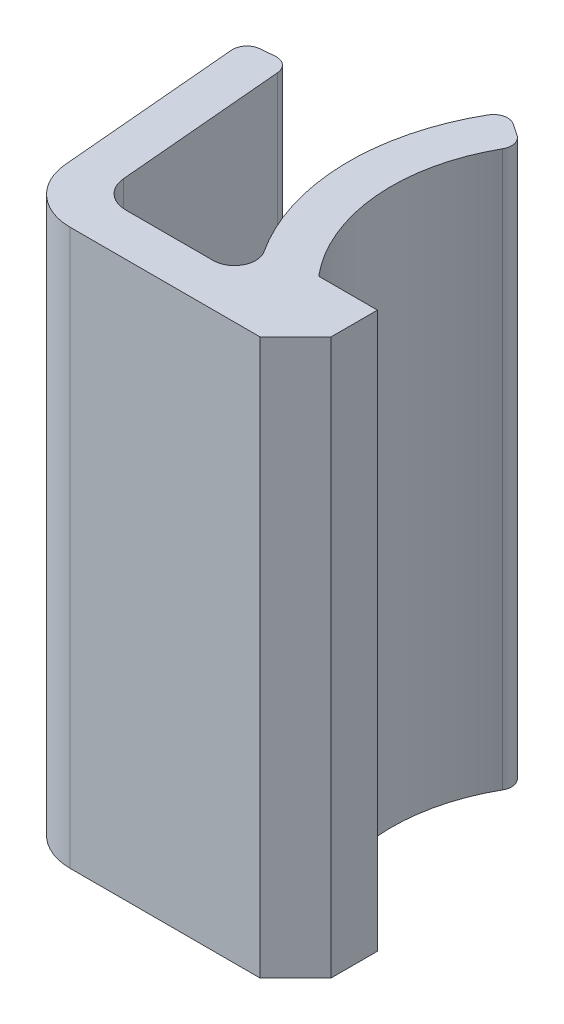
ISO-10303-21;
HEADER;
FILE_DESCRIPTION(('STEP AP214'),'2;1');
FILE_NAME('part.step','',(''),(''),'','','');
FILE_SCHEMA(('AUTOMOTIVE_DESIGN { 1 0 10303 214 1 1 1 1 }'));
ENDSEC;
DATA;
#1=APPLICATION_CONTEXT('core data for automotive mechanical design processes');
#2=APPLICATION_PROTOCOL_DEFINITION('international standard','automotive_design',2000,#1);
#3=PRODUCT_CONTEXT('',#1,'mechanical');
#4=PRODUCT('Part','Part','',(#3));
#5=PRODUCT_RELATED_PRODUCT_CATEGORY('part','',(#4));
#6=PRODUCT_DEFINITION_FORMATION('','',#4);
#7=PRODUCT_DEFINITION_CONTEXT('part definition',#1,'design');
#8=PRODUCT_DEFINITION('design','',#6,#7);
#9=PRODUCT_DEFINITION_SHAPE('','',#8);
#10=(LENGTH_UNIT() NAMED_UNIT(*) SI_UNIT(.MILLI.,.METRE.));
#11=(NAMED_UNIT(*) PLANE_ANGLE_UNIT() SI_UNIT($,.RADIAN.));
#12=(NAMED_UNIT(*) SI_UNIT($,.STERADIAN.) SOLID_ANGLE_UNIT());
#13=UNCERTAINTY_MEASURE_WITH_UNIT(LENGTH_MEASURE(1.E-05),#10,'distance_accuracy_value','');
#14=(GEOMETRIC_REPRESENTATION_CONTEXT(3) GLOBAL_UNCERTAINTY_ASSIGNED_CONTEXT((#13)) GLOBAL_UNIT_ASSIGNED_CONTEXT((#10,
#11,#12)) REPRESENTATION_CONTEXT('',''));
#15=CARTESIAN_POINT('',(0.,0.,0.));
#16=DIRECTION('',(0.,0.,1.));
#17=DIRECTION('',(1.,0.,0.));
#18=AXIS2_PLACEMENT_3D('',#15,#16,#17);
#19=CARTESIAN_POINT('',(0.,7.8,-2.3));
#20=DIRECTION('',(-1.,0.,0.));
#21=DIRECTION('',(0.,0.,1.));
#22=AXIS2_PLACEMENT_3D('',#19,#20,#21);
#23=PLANE('',#22);
#24=DIRECTION('',(0.,0.,-1.));
#25=VECTOR('',#24,1.);
#26=CARTESIAN_POINT('',(0.,7.8,-2.3));
#27=LINE('',#26,#25);
#28=CARTESIAN_POINT('',(0.,7.8,-0.999999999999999));
#29=VERTEX_POINT('',#28);
#30=CARTESIAN_POINT('',(0.,7.8,-2.3));
#31=VERTEX_POINT('',#30);
#32=EDGE_CURVE('E166',#29,#31,#27,.T.);
#33=ORIENTED_EDGE('',*,*,#32,.F.);
#34=DIRECTION('',(0.,-1.,0.));
#35=VECTOR('',#34,1.);
#36=CARTESIAN_POINT('',(0.,7.8,-0.999999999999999));
#37=LINE('',#36,#35);
#38=CARTESIAN_POINT('',(0.,-7.8,-0.999999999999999));
#39=VERTEX_POINT('',#38);
#40=EDGE_CURVE('E258',#29,#39,#37,.T.);
#41=ORIENTED_EDGE('',*,*,#40,.T.);
#42=DIRECTION('',(0.,0.,-1.));
#43=VECTOR('',#42,1.);
#44=CARTESIAN_POINT('',(0.,-7.8,-2.3));
#45=LINE('',#44,#43);
#46=CARTESIAN_POINT('',(0.,-7.8,-2.3));
#47=VERTEX_POINT('',#46);
#48=EDGE_CURVE('E188',#39,#47,#45,.T.);
#49=ORIENTED_EDGE('',*,*,#48,.T.);
#50=DIRECTION('',(0.,-1.,0.));
#51=VECTOR('',#50,1.);
#52=CARTESIAN_POINT('',(0.,7.8,-2.3));
#53=LINE('',#52,#51);
#54=EDGE_CURVE('E182',#31,#47,#53,.T.);
#55=ORIENTED_EDGE('',*,*,#54,.F.);
#56=EDGE_LOOP('',(#33,#41,#49,#55));
#57=FACE_BOUND('',#56,.T.);
#58=ADVANCED_FACE('F41',(#57),#23,.F.);
#59=CARTESIAN_POINT('',(-1.65,7.8,-2.3));
#60=DIRECTION('',(0.,0.,1.));
#61=DIRECTION('',(1.,0.,0.));
#62=AXIS2_PLACEMENT_3D('',#59,#60,#61);
#63=PLANE('',#62);
#64=DIRECTION('',(-1.,0.,0.));
#65=VECTOR('',#64,1.);
#66=CARTESIAN_POINT('',(-1.65,-7.8,-2.3));
#67=LINE('',#66,#65);
#68=CARTESIAN_POINT('',(-1.65,-7.8,-2.3));
#69=VERTEX_POINT('',#68);
#70=EDGE_CURVE('E263',#47,#69,#67,.T.);
#71=ORIENTED_EDGE('',*,*,#70,.T.);
#72=DIRECTION('',(0.,-1.,0.));
#73=VECTOR('',#72,1.);
#74=CARTESIAN_POINT('',(-1.65,7.8,-2.3));
#75=LINE('',#74,#73);
#76=CARTESIAN_POINT('',(-1.65,7.8,-2.3));
#77=VERTEX_POINT('',#76);
#78=EDGE_CURVE('E184',#77,#69,#75,.T.);
#79=ORIENTED_EDGE('',*,*,#78,.F.);
#80=DIRECTION('',(-1.,0.,0.));
#81=VECTOR('',#80,1.);
#82=CARTESIAN_POINT('',(-1.65,7.8,-2.3));
#83=LINE('',#82,#81);
#84=EDGE_CURVE('E170',#31,#77,#83,.T.);
#85=ORIENTED_EDGE('',*,*,#84,.F.);
#86=ORIENTED_EDGE('',*,*,#54,.T.);
#87=EDGE_LOOP('',(#71,#79,#85,#86));
#88=FACE_BOUND('',#87,.T.);
#89=ADVANCED_FACE('F181',(#88),#63,.F.);
#90=CARTESIAN_POINT('',(2.18022221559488,7.8,-5.51393804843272));
#91=DIRECTION('',(0.,-1.,0.));
#92=DIRECTION('',(0.,0.,-1.));
#93=AXIS2_PLACEMENT_3D('',#90,#91,#92);
#94=CYLINDRICAL_SURFACE('',#93,5.);
#95=CARTESIAN_POINT('',(2.18022221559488,-7.8,-5.51393804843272));
#96=DIRECTION('',(0.,-1.,0.));
#97=DIRECTION('',(0.,0.,-1.));
#98=AXIS2_PLACEMENT_3D('',#95,#96,#97);
#99=CIRCLE('',#98,5.);
#100=CARTESIAN_POINT('',(-2.16659658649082,-7.8,-7.98480152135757));
#101=VERTEX_POINT('',#100);
#102=EDGE_CURVE('E265',#69,#101,#99,.T.);
#103=ORIENTED_EDGE('',*,*,#102,.T.);
#104=DIRECTION('',(0.,-1.,0.));
#105=VECTOR('',#104,1.);
#106=CARTESIAN_POINT('',(-2.16659658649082,7.8,-7.98480152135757));
#107=LINE('',#106,#105);
#108=CARTESIAN_POINT('',(-2.16659658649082,7.8,-7.98480152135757));
#109=VERTEX_POINT('',#108);
#110=EDGE_CURVE('E243',#101,#109,#107,.F.);
#111=ORIENTED_EDGE('',*,*,#110,.T.);
#112=CARTESIAN_POINT('',(2.18022221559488,7.8,-5.51393804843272));
#113=DIRECTION('',(0.,-1.,0.));
#114=DIRECTION('',(0.,0.,-1.));
#115=AXIS2_PLACEMENT_3D('',#112,#113,#114);
#116=CIRCLE('',#115,5.);
#117=EDGE_CURVE('E186',#77,#109,#116,.T.);
#118=ORIENTED_EDGE('',*,*,#117,.F.);
#119=ORIENTED_EDGE('',*,*,#78,.T.);
#120=EDGE_LOOP('',(#103,#111,#118,#119));
#121=FACE_BOUND('',#120,.T.);
#122=ADVANCED_FACE('F303',(#121),#94,.F.);
#123=CARTESIAN_POINT('',(-2.96807184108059,7.8,-8.96865486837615));
#124=DIRECTION('',(-0.557212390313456,0.,0.830370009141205));
#125=DIRECTION('',(0.830370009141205,0.,0.557212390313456));
#126=AXIS2_PLACEMENT_3D('',#123,#124,#125);
#127=PLANE('',#126);
#128=DIRECTION('',(-0.830370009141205,0.,-0.557212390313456));
#129=VECTOR('',#128,1.);
#130=CARTESIAN_POINT('',(-2.96807184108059,7.8,-8.96865486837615));
#131=LINE('',#130,#129);
#132=CARTESIAN_POINT('',(-2.2914571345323,7.8,-8.51461860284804));
#133=VERTEX_POINT('',#132);
#134=CARTESIAN_POINT('',(-2.62445680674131,7.8,-8.73807506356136));
#135=VERTEX_POINT('',#134);
#136=EDGE_CURVE('E356',#133,#135,#131,.T.);
#137=ORIENTED_EDGE('',*,*,#136,.F.);
#138=DIRECTION('',(0.,-1.,0.));
#139=VECTOR('',#138,1.);
#140=CARTESIAN_POINT('',(-2.2914571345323,7.8,-8.51461860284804));
#141=LINE('',#140,#139);
#142=CARTESIAN_POINT('',(-2.2914571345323,-7.8,-8.51461860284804));
#143=VERTEX_POINT('',#142);
#144=EDGE_CURVE('E240',#133,#143,#141,.T.);
#145=ORIENTED_EDGE('',*,*,#144,.T.);
#146=DIRECTION('',(-0.830370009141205,0.,-0.557212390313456));
#147=VECTOR('',#146,1.);
#148=CARTESIAN_POINT('',(-2.96807184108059,-7.8,-8.96865486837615));
#149=LINE('',#148,#147);
#150=CARTESIAN_POINT('',(-2.62445680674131,-7.8,-8.73807506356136));
#151=VERTEX_POINT('',#150);
#152=EDGE_CURVE('E272',#143,#151,#149,.T.);
#153=ORIENTED_EDGE('',*,*,#152,.T.);
#154=DIRECTION('',(0.,-1.,0.));
#155=VECTOR('',#154,1.);
#156=CARTESIAN_POINT('',(-2.62445680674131,7.8,-8.73807506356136));
#157=LINE('',#156,#155);
#158=EDGE_CURVE('E238',#151,#135,#157,.F.);
#159=ORIENTED_EDGE('',*,*,#158,.T.);
#160=EDGE_LOOP('',(#137,#145,#153,#159));
#161=FACE_BOUND('',#160,.T.);
#162=ADVANCED_FACE('F366',(#161),#127,.F.);
#163=CARTESIAN_POINT('',(2.18022221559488,7.8,-5.51393804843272));
#164=DIRECTION('',(0.,-1.,0.));
#165=DIRECTION('',(0.,0.,-1.));
#166=AXIS2_PLACEMENT_3D('',#163,#164,#165);
#167=CYLINDRICAL_SURFACE('',#166,6.2);
#168=CARTESIAN_POINT('',(2.18022221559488,-7.8,-5.51393804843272));
#169=DIRECTION('',(0.,1.,0.));
#170=DIRECTION('',(0.,0.,-1.));
#171=AXIS2_PLACEMENT_3D('',#168,#169,#170);
#172=CIRCLE('',#171,6.2);
#173=CARTESIAN_POINT('',(-3.19407031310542,-7.8,-8.60537457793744));
#174=VERTEX_POINT('',#173);
#175=CARTESIAN_POINT('',(-3.01336947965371,-7.8,-2.12770041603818));
#176=VERTEX_POINT('',#175);
#177=EDGE_CURVE('E275',#174,#176,#172,.T.);
#178=ORIENTED_EDGE('',*,*,#177,.T.);
#179=DIRECTION('',(0.,-1.,0.));
#180=VECTOR('',#179,1.);
#181=CARTESIAN_POINT('',(-3.01336947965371,7.8,-2.12770041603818));
#182=LINE('',#181,#180);
#183=CARTESIAN_POINT('',(-3.01336947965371,7.8,-2.12770041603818));
#184=VERTEX_POINT('',#183);
#185=EDGE_CURVE('E236',#176,#184,#182,.F.);
#186=ORIENTED_EDGE('',*,*,#185,.T.);
#187=CARTESIAN_POINT('',(2.18022221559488,7.8,-5.51393804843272));
#188=DIRECTION('',(0.,1.,0.));
#189=DIRECTION('',(0.,0.,-1.));
#190=AXIS2_PLACEMENT_3D('',#187,#188,#189);
#191=CIRCLE('',#190,6.2);
#192=CARTESIAN_POINT('',(-3.19407031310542,7.8,-8.60537457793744));
#193=VERTEX_POINT('',#192);
#194=EDGE_CURVE('E353',#193,#184,#191,.T.);
#195=ORIENTED_EDGE('',*,*,#194,.F.);
#196=DIRECTION('',(0.,-1.,0.));
#197=VECTOR('',#196,1.);
#198=CARTESIAN_POINT('',(-3.19407031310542,7.8,-8.60537457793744));
#199=LINE('',#198,#197);
#200=EDGE_CURVE('E233',#193,#174,#199,.T.);
#201=ORIENTED_EDGE('',*,*,#200,.T.);
#202=EDGE_LOOP('',(#178,#186,#195,#201));
#203=FACE_BOUND('',#202,.T.);
#204=ADVANCED_FACE('F373',(#203),#167,.T.);
#205=CARTESIAN_POINT('',(-6.70040259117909,7.8,-1.2));
#206=DIRECTION('',(0.,0.,1.));
#207=DIRECTION('',(1.,0.,0.));
#208=AXIS2_PLACEMENT_3D('',#205,#206,#207);
#209=PLANE('',#208);
#210=DIRECTION('',(-1.,0.,0.));
#211=VECTOR('',#210,1.);
#212=CARTESIAN_POINT('',(-6.70040259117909,-7.8,-1.2));
#213=LINE('',#212,#211);
#214=CARTESIAN_POINT('',(-3.51597512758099,-7.8,-1.2));
#215=VERTEX_POINT('',#214);
#216=CARTESIAN_POINT('',(-5.96733765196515,-7.8,-1.2));
#217=VERTEX_POINT('',#216);
#218=EDGE_CURVE('E278',#215,#217,#213,.T.);
#219=ORIENTED_EDGE('',*,*,#218,.T.);
#220=DIRECTION('',(0.,-1.,0.));
#221=VECTOR('',#220,1.);
#222=CARTESIAN_POINT('',(-5.96733765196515,7.8,-1.2));
#223=LINE('',#222,#221);
#224=CARTESIAN_POINT('',(-5.96733765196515,7.8,-1.2));
#225=VERTEX_POINT('',#224);
#226=EDGE_CURVE('E231',#217,#225,#223,.F.);
#227=ORIENTED_EDGE('',*,*,#226,.T.);
#228=DIRECTION('',(-1.,0.,0.));
#229=VECTOR('',#228,1.);
#230=CARTESIAN_POINT('',(-6.70040259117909,7.8,-1.2));
#231=LINE('',#230,#229);
#232=CARTESIAN_POINT('',(-3.51597512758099,7.8,-1.2));
#233=VERTEX_POINT('',#232);
#234=EDGE_CURVE('E350',#233,#225,#231,.T.);
#235=ORIENTED_EDGE('',*,*,#234,.F.);
#236=DIRECTION('',(0.,1.,0.));
#237=VECTOR('',#236,1.);
#238=CARTESIAN_POINT('',(-3.51597512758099,-7.8,-1.2));
#239=LINE('',#238,#237);
#240=EDGE_CURVE('E228',#233,#215,#239,.F.);
#241=ORIENTED_EDGE('',*,*,#240,.T.);
#242=EDGE_LOOP('',(#219,#227,#235,#241));
#243=FACE_BOUND('',#242,.T.);
#244=ADVANCED_FACE('F380',(#243),#209,.F.);
#245=CARTESIAN_POINT('',(-7.21465656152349,7.8,-7.07794977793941));
#246=DIRECTION('',(-0.996194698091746,0.,0.0871557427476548));
#247=DIRECTION('',(0.0871557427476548,0.,0.996194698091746));
#248=AXIS2_PLACEMENT_3D('',#245,#246,#247);
#249=PLANE('',#248);
#250=DIRECTION('',(-0.0871557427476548,0.,-0.996194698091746));
#251=VECTOR('',#250,1.);
#252=CARTESIAN_POINT('',(-7.21465656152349,7.8,-7.07794977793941));
#253=LINE('',#252,#251);
#254=CARTESIAN_POINT('',(-6.76429341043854,7.8,-1.93027540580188));
#255=VERTEX_POINT('',#254);
#256=CARTESIAN_POINT('',(-7.17979426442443,7.8,-6.67947189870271));
#257=VERTEX_POINT('',#256);
#258=EDGE_CURVE('E345',#255,#257,#253,.T.);
#259=ORIENTED_EDGE('',*,*,#258,.F.);
#260=DIRECTION('',(0.,-1.,0.));
#261=VECTOR('',#260,1.);
#262=CARTESIAN_POINT('',(-6.76429341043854,-7.8,-1.93027540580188));
#263=LINE('',#262,#261);
#264=CARTESIAN_POINT('',(-6.76429341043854,-7.8,-1.93027540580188));
#265=VERTEX_POINT('',#264);
#266=EDGE_CURVE('E225',#255,#265,#263,.T.);
#267=ORIENTED_EDGE('',*,*,#266,.T.);
#268=DIRECTION('',(-0.0871557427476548,0.,-0.996194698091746));
#269=VECTOR('',#268,1.);
#270=CARTESIAN_POINT('',(-7.21465656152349,-7.8,-7.07794977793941));
#271=LINE('',#270,#269);
#272=CARTESIAN_POINT('',(-7.17979426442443,-7.8,-6.67947189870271));
#273=VERTEX_POINT('',#272);
#274=EDGE_CURVE('E281',#265,#273,#271,.T.);
#275=ORIENTED_EDGE('',*,*,#274,.T.);
#276=DIRECTION('',(0.,-1.,0.));
#277=VECTOR('',#276,1.);
#278=CARTESIAN_POINT('',(-7.17979426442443,7.8,-6.67947189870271));
#279=LINE('',#278,#277);
#280=EDGE_CURVE('E223',#273,#257,#279,.F.);
#281=ORIENTED_EDGE('',*,*,#280,.T.);
#282=EDGE_LOOP('',(#259,#267,#275,#281));
#283=FACE_BOUND('',#282,.T.);
#284=ADVANCED_FACE('F387',(#283),#249,.F.);
#285=CARTESIAN_POINT('',(-8.41009019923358,7.8,-6.97336288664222));
#286=DIRECTION('',(0.0871557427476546,0.,0.996194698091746));
#287=DIRECTION('',(0.996194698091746,0.,-0.0871557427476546));
#288=AXIS2_PLACEMENT_3D('',#285,#286,#287);
#289=PLANE('',#288);
#290=DIRECTION('',(-0.996194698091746,0.,0.0871557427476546));
#291=VECTOR('',#290,1.);
#292=CARTESIAN_POINT('',(-8.41009019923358,-7.8,-6.97336288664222));
#293=LINE('',#292,#291);
#294=CARTESIAN_POINT('',(-7.61313444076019,-7.8,-7.04308748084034));
#295=VERTEX_POINT('',#294);
#296=CARTESIAN_POINT('',(-8.01161231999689,-7.8,-7.00822518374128));
#297=VERTEX_POINT('',#296);
#298=EDGE_CURVE('E284',#295,#297,#293,.T.);
#299=ORIENTED_EDGE('',*,*,#298,.T.);
#300=DIRECTION('',(0.,-1.,0.));
#301=VECTOR('',#300,1.);
#302=CARTESIAN_POINT('',(-8.01161231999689,7.8,-7.00822518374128));
#303=LINE('',#302,#301);
#304=CARTESIAN_POINT('',(-8.01161231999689,7.8,-7.00822518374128));
#305=VERTEX_POINT('',#304);
#306=EDGE_CURVE('E248',#297,#305,#303,.F.);
#307=ORIENTED_EDGE('',*,*,#306,.T.);
#308=DIRECTION('',(-0.996194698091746,0.,0.0871557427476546));
#309=VECTOR('',#308,1.);
#310=CARTESIAN_POINT('',(-8.41009019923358,7.8,-6.97336288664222));
#311=LINE('',#310,#309);
#312=CARTESIAN_POINT('',(-7.61313444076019,7.8,-7.04308748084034));
#313=VERTEX_POINT('',#312);
#314=EDGE_CURVE('E340',#313,#305,#311,.T.);
#315=ORIENTED_EDGE('',*,*,#314,.F.);
#316=DIRECTION('',(0.,-1.,0.));
#317=VECTOR('',#316,1.);
#318=CARTESIAN_POINT('',(-7.61313444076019,7.8,-7.04308748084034));
#319=LINE('',#318,#317);
#320=EDGE_CURVE('E245',#313,#295,#319,.T.);
#321=ORIENTED_EDGE('',*,*,#320,.T.);
#322=EDGE_LOOP('',(#299,#307,#315,#321));
#323=FACE_BOUND('',#322,.T.);
#324=ADVANCED_FACE('F393',(#323),#289,.F.);
#325=CARTESIAN_POINT('',(-7.8,7.8,0.));
#326=DIRECTION('',(0.996194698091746,0.,-0.087155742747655));
#327=DIRECTION('',(-0.087155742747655,0.,-0.996194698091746));
#328=AXIS2_PLACEMENT_3D('',#325,#326,#327);
#329=PLANE('',#328);
#330=DIRECTION('',(0.087155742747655,0.,0.996194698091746));
#331=VECTOR('',#330,1.);
#332=CARTESIAN_POINT('',(-7.8,-7.8,0.));
#333=LINE('',#332,#331);
#334=CARTESIAN_POINT('',(-8.37522790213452,-7.8,-6.57488500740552));
#335=VERTEX_POINT('',#334);
#336=CARTESIAN_POINT('',(-7.92778163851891,-7.8,-1.46055081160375));
#337=VERTEX_POINT('',#336);
#338=EDGE_CURVE('E287',#335,#337,#333,.T.);
#339=ORIENTED_EDGE('',*,*,#338,.T.);
#340=DIRECTION('',(0.,-1.,0.));
#341=VECTOR('',#340,1.);
#342=CARTESIAN_POINT('',(-7.92778163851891,7.8,-1.46055081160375));
#343=LINE('',#342,#341);
#344=CARTESIAN_POINT('',(-7.92778163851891,7.8,-1.46055081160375));
#345=VERTEX_POINT('',#344);
#346=EDGE_CURVE('E211',#337,#345,#343,.F.);
#347=ORIENTED_EDGE('',*,*,#346,.T.);
#348=DIRECTION('',(0.087155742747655,0.,0.996194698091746));
#349=VECTOR('',#348,1.);
#350=CARTESIAN_POINT('',(-7.8,7.8,0.));
#351=LINE('',#350,#349);
#352=CARTESIAN_POINT('',(-8.37522790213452,7.8,-6.57488500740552));
#353=VERTEX_POINT('',#352);
#354=EDGE_CURVE('E337',#353,#345,#351,.T.);
#355=ORIENTED_EDGE('',*,*,#354,.F.);
#356=DIRECTION('',(0.,-1.,0.));
#357=VECTOR('',#356,1.);
#358=CARTESIAN_POINT('',(-8.37522790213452,7.8,-6.57488500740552));
#359=LINE('',#358,#357);
#360=EDGE_CURVE('E208',#353,#335,#359,.T.);
#361=ORIENTED_EDGE('',*,*,#360,.T.);
#362=EDGE_LOOP('',(#339,#347,#355,#361));
#363=FACE_BOUND('',#362,.T.);
#364=ADVANCED_FACE('F342',(#363),#329,.F.);
#365=CARTESIAN_POINT('',(0.,7.8,0.));
#366=DIRECTION('',(0.,0.,-1.));
#367=DIRECTION('',(-1.,0.,0.));
#368=AXIS2_PLACEMENT_3D('',#365,#366,#367);
#369=PLANE('',#368);
#370=DIRECTION('',(1.,0.,0.));
#371=VECTOR('',#370,1.);
#372=CARTESIAN_POINT('',(0.,-7.8,0.));
#373=LINE('',#372,#371);
#374=CARTESIAN_POINT('',(-6.33387012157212,-7.8,0.));
#375=VERTEX_POINT('',#374);
#376=CARTESIAN_POINT('',(-1.,-7.8,0.));
#377=VERTEX_POINT('',#376);
#378=EDGE_CURVE('E177',#375,#377,#373,.T.);
#379=ORIENTED_EDGE('',*,*,#378,.T.);
#380=DIRECTION('',(0.,1.,0.));
#381=VECTOR('',#380,1.);
#382=CARTESIAN_POINT('',(-1.,7.8,0.));
#383=LINE('',#382,#381);
#384=CARTESIAN_POINT('',(-1.,7.8,0.));
#385=VERTEX_POINT('',#384);
#386=EDGE_CURVE('E50',#377,#385,#383,.T.);
#387=ORIENTED_EDGE('',*,*,#386,.T.);
#388=DIRECTION('',(1.,0.,0.));
#389=VECTOR('',#388,1.);
#390=CARTESIAN_POINT('',(0.,7.8,0.));
#391=LINE('',#390,#389);
#392=CARTESIAN_POINT('',(-6.33387012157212,7.8,0.));
#393=VERTEX_POINT('',#392);
#394=EDGE_CURVE('E195',#393,#385,#391,.T.);
#395=ORIENTED_EDGE('',*,*,#394,.F.);
#396=DIRECTION('',(0.,-1.,0.));
#397=VECTOR('',#396,1.);
#398=CARTESIAN_POINT('',(-6.33387012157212,7.8,0.));
#399=LINE('',#398,#397);
#400=EDGE_CURVE('E190',#393,#375,#399,.T.);
#401=ORIENTED_EDGE('',*,*,#400,.T.);
#402=EDGE_LOOP('',(#379,#387,#395,#401));
#403=FACE_BOUND('',#402,.T.);
#404=ADVANCED_FACE('F289',(#403),#369,.F.);
#405=CARTESIAN_POINT('',(2.18022221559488,7.8,-5.51393804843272));
#406=DIRECTION('',(0.,-1.,0.));
#407=DIRECTION('',(0.,0.,-1.));
#408=AXIS2_PLACEMENT_3D('',#405,#406,#407);
#409=PLANE('',#408);
#410=ORIENTED_EDGE('',*,*,#394,.T.);
#411=DIRECTION('',(-0.707106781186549,0.,0.707106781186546));
#412=VECTOR('',#411,1.);
#413=CARTESIAN_POINT('',(0.,7.8,-0.999999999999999));
#414=LINE('',#413,#412);
#415=EDGE_CURVE('E12',#385,#29,#414,.F.);
#416=ORIENTED_EDGE('',*,*,#415,.T.);
#417=ORIENTED_EDGE('',*,*,#32,.T.);
#418=ORIENTED_EDGE('',*,*,#84,.T.);
#419=ORIENTED_EDGE('',*,*,#117,.T.);
#420=CARTESIAN_POINT('',(-2.51434209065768,7.8,-8.18247059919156));
#421=DIRECTION('',(0.,-1.,0.));
#422=DIRECTION('',(0.,0.,-1.));
#423=AXIS2_PLACEMENT_3D('',#420,#421,#422);
#424=CIRCLE('',#423,0.4);
#425=EDGE_CURVE('E219',#109,#133,#424,.F.);
#426=ORIENTED_EDGE('',*,*,#425,.T.);
#427=ORIENTED_EDGE('',*,*,#136,.T.);
#428=CARTESIAN_POINT('',(-2.84734176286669,7.8,-8.40592705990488));
#429=DIRECTION('',(0.,-1.,0.));
#430=DIRECTION('',(0.,0.,-1.));
#431=AXIS2_PLACEMENT_3D('',#428,#429,#430);
#432=CIRCLE('',#431,0.4);
#433=EDGE_CURVE('E217',#135,#193,#432,.F.);
#434=ORIENTED_EDGE('',*,*,#433,.T.);
#435=ORIENTED_EDGE('',*,*,#194,.T.);
#436=CARTESIAN_POINT('',(-3.51597512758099,7.8,-1.8));
#437=DIRECTION('',(0.,-1.,0.));
#438=DIRECTION('',(0.,0.,-1.));
#439=AXIS2_PLACEMENT_3D('',#436,#437,#438);
#440=CIRCLE('',#439,0.6);
#441=EDGE_CURVE('E256',#184,#233,#440,.T.);
#442=ORIENTED_EDGE('',*,*,#441,.T.);
#443=ORIENTED_EDGE('',*,*,#234,.T.);
#444=CARTESIAN_POINT('',(-5.96733765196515,7.8,-2.));
#445=DIRECTION('',(0.,-1.,0.));
#446=DIRECTION('',(0.,0.,-1.));
#447=AXIS2_PLACEMENT_3D('',#444,#445,#446);
#448=CIRCLE('',#447,0.8);
#449=EDGE_CURVE('E252',#225,#255,#448,.T.);
#450=ORIENTED_EDGE('',*,*,#449,.T.);
#451=ORIENTED_EDGE('',*,*,#258,.T.);
#452=CARTESIAN_POINT('',(-7.57827214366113,7.8,-6.64460960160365));
#453=DIRECTION('',(0.,-1.,0.));
#454=DIRECTION('',(0.,0.,-1.));
#455=AXIS2_PLACEMENT_3D('',#452,#453,#454);
#456=CIRCLE('',#455,0.4);
#457=EDGE_CURVE('E213',#257,#313,#456,.F.);
#458=ORIENTED_EDGE('',*,*,#457,.T.);
#459=ORIENTED_EDGE('',*,*,#314,.T.);
#460=CARTESIAN_POINT('',(-7.97675002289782,7.8,-6.60974730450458));
#461=DIRECTION('',(0.,-1.,0.));
#462=DIRECTION('',(0.,0.,-1.));
#463=AXIS2_PLACEMENT_3D('',#460,#461,#462);
#464=CIRCLE('',#463,0.4);
#465=EDGE_CURVE('E215',#305,#353,#464,.F.);
#466=ORIENTED_EDGE('',*,*,#465,.T.);
#467=ORIENTED_EDGE('',*,*,#354,.T.);
#468=CARTESIAN_POINT('',(-6.33387012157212,7.8,-1.6));
#469=DIRECTION('',(0.,-1.,0.));
#470=DIRECTION('',(0.,0.,-1.));
#471=AXIS2_PLACEMENT_3D('',#468,#469,#470);
#472=CIRCLE('',#471,1.6);
#473=EDGE_CURVE('E221',#345,#393,#472,.F.);
#474=ORIENTED_EDGE('',*,*,#473,.T.);
#475=EDGE_LOOP('',(#410,#416,#417,#418,#419,#426,#427,#434,#435,#442,#443,#450,#451,#458,#459,
#466,#467,#474));
#476=FACE_BOUND('',#475,.T.);
#477=ADVANCED_FACE('F168',(#476),#409,.F.);
#478=CARTESIAN_POINT('',(2.18022221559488,-7.8,-5.51393804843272));
#479=DIRECTION('',(0.,-1.,0.));
#480=DIRECTION('',(0.,0.,-1.));
#481=AXIS2_PLACEMENT_3D('',#478,#479,#480);
#482=PLANE('',#481);
#483=ORIENTED_EDGE('',*,*,#48,.F.);
#484=DIRECTION('',(0.707106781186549,0.,-0.707106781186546));
#485=VECTOR('',#484,1.);
#486=CARTESIAN_POINT('',(3.3470801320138,-7.8,-4.34708013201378));
#487=LINE('',#486,#485);
#488=EDGE_CURVE('E64',#39,#377,#487,.F.);
#489=ORIENTED_EDGE('',*,*,#488,.T.);
#490=ORIENTED_EDGE('',*,*,#378,.F.);
#491=CARTESIAN_POINT('',(-6.33387012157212,-7.8,-1.6));
#492=DIRECTION('',(0.,-1.,0.));
#493=DIRECTION('',(0.,0.,-1.));
#494=AXIS2_PLACEMENT_3D('',#491,#492,#493);
#495=CIRCLE('',#494,1.6);
#496=EDGE_CURVE('E206',#375,#337,#495,.T.);
#497=ORIENTED_EDGE('',*,*,#496,.T.);
#498=ORIENTED_EDGE('',*,*,#338,.F.);
#499=CARTESIAN_POINT('',(-7.97675002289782,-7.8,-6.60974730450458));
#500=DIRECTION('',(0.,-1.,0.));
#501=DIRECTION('',(0.,0.,-1.));
#502=AXIS2_PLACEMENT_3D('',#499,#500,#501);
#503=CIRCLE('',#502,0.4);
#504=EDGE_CURVE('E200',#335,#297,#503,.T.);
#505=ORIENTED_EDGE('',*,*,#504,.T.);
#506=ORIENTED_EDGE('',*,*,#298,.F.);
#507=CARTESIAN_POINT('',(-7.57827214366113,-7.8,-6.64460960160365));
#508=DIRECTION('',(0.,-1.,0.));
#509=DIRECTION('',(0.,0.,-1.));
#510=AXIS2_PLACEMENT_3D('',#507,#508,#509);
#511=CIRCLE('',#510,0.4);
#512=EDGE_CURVE('E193',#295,#273,#511,.T.);
#513=ORIENTED_EDGE('',*,*,#512,.T.);
#514=ORIENTED_EDGE('',*,*,#274,.F.);
#515=CARTESIAN_POINT('',(-5.96733765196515,-7.8,-2.));
#516=DIRECTION('',(0.,-1.,0.));
#517=DIRECTION('',(0.,0.,-1.));
#518=AXIS2_PLACEMENT_3D('',#515,#516,#517);
#519=CIRCLE('',#518,0.8);
#520=EDGE_CURVE('E250',#265,#217,#519,.F.);
#521=ORIENTED_EDGE('',*,*,#520,.T.);
#522=ORIENTED_EDGE('',*,*,#218,.F.);
#523=CARTESIAN_POINT('',(-3.51597512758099,-7.8,-1.8));
#524=DIRECTION('',(0.,-1.,0.));
#525=DIRECTION('',(0.,0.,-1.));
#526=AXIS2_PLACEMENT_3D('',#523,#524,#525);
#527=CIRCLE('',#526,0.6);
#528=EDGE_CURVE('E254',#215,#176,#527,.F.);
#529=ORIENTED_EDGE('',*,*,#528,.T.);
#530=ORIENTED_EDGE('',*,*,#177,.F.);
#531=CARTESIAN_POINT('',(-2.84734176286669,-7.8,-8.40592705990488));
#532=DIRECTION('',(0.,-1.,0.));
#533=DIRECTION('',(0.,0.,-1.));
#534=AXIS2_PLACEMENT_3D('',#531,#532,#533);
#535=CIRCLE('',#534,0.4);
#536=EDGE_CURVE('E202',#174,#151,#535,.T.);
#537=ORIENTED_EDGE('',*,*,#536,.T.);
#538=ORIENTED_EDGE('',*,*,#152,.F.);
#539=CARTESIAN_POINT('',(-2.51434209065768,-7.8,-8.18247059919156));
#540=DIRECTION('',(0.,-1.,0.));
#541=DIRECTION('',(0.,0.,-1.));
#542=AXIS2_PLACEMENT_3D('',#539,#540,#541);
#543=CIRCLE('',#542,0.4);
#544=EDGE_CURVE('E204',#143,#101,#543,.T.);
#545=ORIENTED_EDGE('',*,*,#544,.T.);
#546=ORIENTED_EDGE('',*,*,#102,.F.);
#547=ORIENTED_EDGE('',*,*,#70,.F.);
#548=EDGE_LOOP('',(#483,#489,#490,#497,#498,#505,#506,#513,#514,#521,#522,#529,#530,#537,#538,
#545,#546,#547));
#549=FACE_BOUND('',#548,.T.);
#550=ADVANCED_FACE('F261',(#549),#482,.T.);
#551=CARTESIAN_POINT('',(-6.33387012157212,7.8,-1.6));
#552=DIRECTION('',(0.,-1.,0.));
#553=DIRECTION('',(0.,0.,-1.));
#554=AXIS2_PLACEMENT_3D('',#551,#552,#553);
#555=CYLINDRICAL_SURFACE('',#554,1.6);
#556=ORIENTED_EDGE('',*,*,#473,.F.);
#557=ORIENTED_EDGE('',*,*,#346,.F.);
#558=ORIENTED_EDGE('',*,*,#496,.F.);
#559=ORIENTED_EDGE('',*,*,#400,.F.);
#560=EDGE_LOOP('',(#556,#557,#558,#559));
#561=FACE_BOUND('',#560,.T.);
#562=ADVANCED_FACE('F307',(#561),#555,.T.);
#563=CARTESIAN_POINT('',(-5.96733765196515,7.8,-2.));
#564=DIRECTION('',(0.,1.,0.));
#565=DIRECTION('',(0.,0.,1.));
#566=AXIS2_PLACEMENT_3D('',#563,#564,#565);
#567=CYLINDRICAL_SURFACE('',#566,0.8);
#568=ORIENTED_EDGE('',*,*,#449,.F.);
#569=ORIENTED_EDGE('',*,*,#226,.F.);
#570=ORIENTED_EDGE('',*,*,#520,.F.);
#571=ORIENTED_EDGE('',*,*,#266,.F.);
#572=EDGE_LOOP('',(#568,#569,#570,#571));
#573=FACE_BOUND('',#572,.T.);
#574=ADVANCED_FACE('F310',(#573),#567,.F.);
#575=CARTESIAN_POINT('',(-3.51597512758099,7.8,-1.8));
#576=DIRECTION('',(0.,-1.,0.));
#577=DIRECTION('',(0.,0.,-1.));
#578=AXIS2_PLACEMENT_3D('',#575,#576,#577);
#579=CYLINDRICAL_SURFACE('',#578,0.6);
#580=ORIENTED_EDGE('',*,*,#441,.F.);
#581=ORIENTED_EDGE('',*,*,#185,.F.);
#582=ORIENTED_EDGE('',*,*,#528,.F.);
#583=ORIENTED_EDGE('',*,*,#240,.F.);
#584=EDGE_LOOP('',(#580,#581,#582,#583));
#585=FACE_BOUND('',#584,.T.);
#586=ADVANCED_FACE('F314',(#585),#579,.F.);
#587=CARTESIAN_POINT('',(-2.51434209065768,7.8,-8.18247059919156));
#588=DIRECTION('',(0.,-1.,0.));
#589=DIRECTION('',(0.,0.,-1.));
#590=AXIS2_PLACEMENT_3D('',#587,#588,#589);
#591=CYLINDRICAL_SURFACE('',#590,0.4);
#592=ORIENTED_EDGE('',*,*,#425,.F.);
#593=ORIENTED_EDGE('',*,*,#110,.F.);
#594=ORIENTED_EDGE('',*,*,#544,.F.);
#595=ORIENTED_EDGE('',*,*,#144,.F.);
#596=EDGE_LOOP('',(#592,#593,#594,#595));
#597=FACE_BOUND('',#596,.T.);
#598=ADVANCED_FACE('F318',(#597),#591,.T.);
#599=CARTESIAN_POINT('',(-2.84734176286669,7.8,-8.40592705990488));
#600=DIRECTION('',(0.,-1.,0.));
#601=DIRECTION('',(0.,0.,-1.));
#602=AXIS2_PLACEMENT_3D('',#599,#600,#601);
#603=CYLINDRICAL_SURFACE('',#602,0.4);
#604=ORIENTED_EDGE('',*,*,#433,.F.);
#605=ORIENTED_EDGE('',*,*,#158,.F.);
#606=ORIENTED_EDGE('',*,*,#536,.F.);
#607=ORIENTED_EDGE('',*,*,#200,.F.);
#608=EDGE_LOOP('',(#604,#605,#606,#607));
#609=FACE_BOUND('',#608,.T.);
#610=ADVANCED_FACE('F322',(#609),#603,.T.);
#611=CARTESIAN_POINT('',(-7.97675002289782,7.8,-6.60974730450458));
#612=DIRECTION('',(0.,-1.,0.));
#613=DIRECTION('',(0.,0.,-1.));
#614=AXIS2_PLACEMENT_3D('',#611,#612,#613);
#615=CYLINDRICAL_SURFACE('',#614,0.4);
#616=ORIENTED_EDGE('',*,*,#465,.F.);
#617=ORIENTED_EDGE('',*,*,#306,.F.);
#618=ORIENTED_EDGE('',*,*,#504,.F.);
#619=ORIENTED_EDGE('',*,*,#360,.F.);
#620=EDGE_LOOP('',(#616,#617,#618,#619));
#621=FACE_BOUND('',#620,.T.);
#622=ADVANCED_FACE('F296',(#621),#615,.T.);
#623=CARTESIAN_POINT('',(-7.57827214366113,7.8,-6.64460960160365));
#624=DIRECTION('',(0.,-1.,0.));
#625=DIRECTION('',(0.,0.,-1.));
#626=AXIS2_PLACEMENT_3D('',#623,#624,#625);
#627=CYLINDRICAL_SURFACE('',#626,0.4);
#628=ORIENTED_EDGE('',*,*,#457,.F.);
#629=ORIENTED_EDGE('',*,*,#280,.F.);
#630=ORIENTED_EDGE('',*,*,#512,.F.);
#631=ORIENTED_EDGE('',*,*,#320,.F.);
#632=EDGE_LOOP('',(#628,#629,#630,#631));
#633=FACE_BOUND('',#632,.T.);
#634=ADVANCED_FACE('F292',(#633),#627,.T.);
#635=CARTESIAN_POINT('',(0.,7.8,-0.999999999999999));
#636=DIRECTION('',(-0.707106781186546,0.,-0.707106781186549));
#637=DIRECTION('',(0.,-1.,0.));
#638=AXIS2_PLACEMENT_3D('',#635,#636,#637);
#639=PLANE('',#638);
#640=ORIENTED_EDGE('',*,*,#415,.F.);
#641=ORIENTED_EDGE('',*,*,#386,.F.);
#642=ORIENTED_EDGE('',*,*,#488,.F.);
#643=ORIENTED_EDGE('',*,*,#40,.F.);
#644=EDGE_LOOP('',(#640,#641,#642,#643));
#645=FACE_BOUND('',#644,.T.);
#646=ADVANCED_FACE('F44',(#645),#639,.F.);
#647=CLOSED_SHELL('',(#58,#89,#122,#162,#204,#244,#284,#324,#364,#404,#477,#550,#562,#574,#586,
#598,#610,#622,#634,#646));
#648=MANIFOLD_SOLID_BREP('B2',#647);
#649=ADVANCED_BREP_SHAPE_REPRESENTATION('',(#18,#648),#14);
#650=SHAPE_DEFINITION_REPRESENTATION(#9,#649);
ENDSEC;
END-ISO-10303-21;
